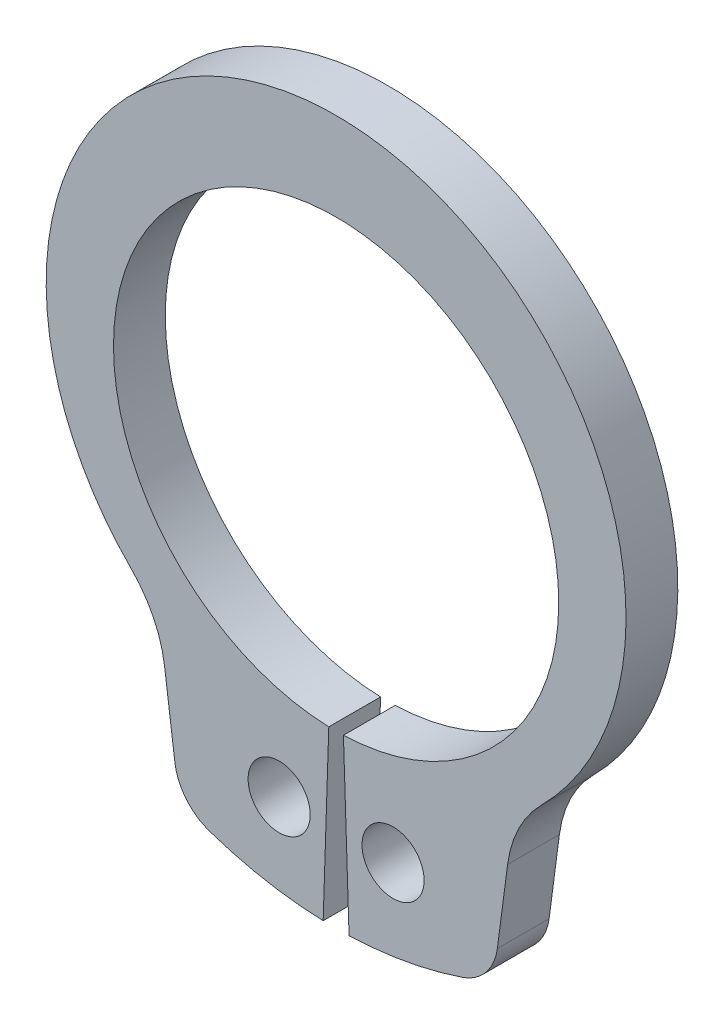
ISO-10303-21;
HEADER;
FILE_DESCRIPTION(('STEP AP214'),'2;1');
FILE_NAME('part.step','',(''),(''),'','','');
FILE_SCHEMA(('AUTOMOTIVE_DESIGN { 1 0 10303 214 1 1 1 1 }'));
ENDSEC;
DATA;
#1=APPLICATION_CONTEXT('core data for automotive mechanical design processes');
#2=APPLICATION_PROTOCOL_DEFINITION('international standard','automotive_design',2000,#1);
#3=PRODUCT_CONTEXT('',#1,'mechanical');
#4=PRODUCT('Part','Part','',(#3));
#5=PRODUCT_RELATED_PRODUCT_CATEGORY('part','',(#4));
#6=PRODUCT_DEFINITION_FORMATION('','',#4);
#7=PRODUCT_DEFINITION_CONTEXT('part definition',#1,'design');
#8=PRODUCT_DEFINITION('design','',#6,#7);
#9=PRODUCT_DEFINITION_SHAPE('','',#8);
#10=(LENGTH_UNIT() NAMED_UNIT(*) SI_UNIT(.MILLI.,.METRE.));
#11=(NAMED_UNIT(*) PLANE_ANGLE_UNIT() SI_UNIT($,.RADIAN.));
#12=(NAMED_UNIT(*) SI_UNIT($,.STERADIAN.) SOLID_ANGLE_UNIT());
#13=UNCERTAINTY_MEASURE_WITH_UNIT(LENGTH_MEASURE(1.E-05),#10,'distance_accuracy_value','');
#14=(GEOMETRIC_REPRESENTATION_CONTEXT(3) GLOBAL_UNCERTAINTY_ASSIGNED_CONTEXT((#13)) GLOBAL_UNIT_ASSIGNED_CONTEXT((#10,
#11,#12)) REPRESENTATION_CONTEXT('',''));
#15=CARTESIAN_POINT('',(0.,0.,0.));
#16=DIRECTION('',(0.,0.,1.));
#17=DIRECTION('',(1.,0.,0.));
#18=AXIS2_PLACEMENT_3D('',#15,#16,#17);
#19=CARTESIAN_POINT('',(0.,0.,-1.));
#20=DIRECTION('',(0.,0.,1.));
#21=DIRECTION('',(1.,0.,0.));
#22=AXIS2_PLACEMENT_3D('',#19,#20,#21);
#23=CYLINDRICAL_SURFACE('',#22,4.3);
#24=CARTESIAN_POINT('',(0.,0.,0.));
#25=DIRECTION('',(0.,0.,-1.));
#26=DIRECTION('',(1.,0.,0.));
#27=AXIS2_PLACEMENT_3D('',#24,#25,#26);
#28=CIRCLE('',#27,4.3);
#29=CARTESIAN_POINT('',(-0.141447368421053,-4.29767293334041,0.));
#30=VERTEX_POINT('',#29);
#31=CARTESIAN_POINT('',(0.141447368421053,-4.29767293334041,0.));
#32=VERTEX_POINT('',#31);
#33=EDGE_CURVE('E154',#30,#32,#28,.T.);
#34=ORIENTED_EDGE('',*,*,#33,.F.);
#35=DIRECTION('',(0.,0.,1.));
#36=VECTOR('',#35,1.);
#37=CARTESIAN_POINT('',(-0.141447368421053,-4.29767293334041,-1.));
#38=LINE('',#37,#36);
#39=CARTESIAN_POINT('',(-0.141447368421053,-4.29767293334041,-1.));
#40=VERTEX_POINT('',#39);
#41=EDGE_CURVE('E11',#40,#30,#38,.T.);
#42=ORIENTED_EDGE('',*,*,#41,.F.);
#43=CARTESIAN_POINT('',(0.,0.,-1.));
#44=DIRECTION('',(0.,0.,-1.));
#45=DIRECTION('',(1.,0.,0.));
#46=AXIS2_PLACEMENT_3D('',#43,#44,#45);
#47=CIRCLE('',#46,4.3);
#48=CARTESIAN_POINT('',(0.141447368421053,-4.29767293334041,-1.));
#49=VERTEX_POINT('',#48);
#50=EDGE_CURVE('E187',#40,#49,#47,.T.);
#51=ORIENTED_EDGE('',*,*,#50,.T.);
#52=DIRECTION('',(0.,0.,1.));
#53=VECTOR('',#52,1.);
#54=CARTESIAN_POINT('',(0.141447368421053,-4.29767293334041,-1.));
#55=LINE('',#54,#53);
#56=EDGE_CURVE('E36',#49,#32,#55,.T.);
#57=ORIENTED_EDGE('',*,*,#56,.T.);
#58=EDGE_LOOP('',(#34,#42,#51,#57));
#59=FACE_BOUND('',#58,.T.);
#60=ADVANCED_FACE('F33',(#59),#23,.F.);
#61=CARTESIAN_POINT('',(-0.141447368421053,-4.29767293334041,-1.));
#62=DIRECTION('',(0.999458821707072,-0.0328947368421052,0.));
#63=DIRECTION('',(0.0328947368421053,0.999458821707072,0.));
#64=AXIS2_PLACEMENT_3D('',#61,#62,#63);
#65=PLANE('',#64);
#66=DIRECTION('',(0.0328947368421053,0.999458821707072,0.));
#67=VECTOR('',#66,1.);
#68=CARTESIAN_POINT('',(-0.141447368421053,-4.29767293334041,0.));
#69=LINE('',#68,#67);
#70=CARTESIAN_POINT('',(-0.25,-7.59588704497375,0.));
#71=VERTEX_POINT('',#70);
#72=EDGE_CURVE('E185',#71,#30,#69,.T.);
#73=ORIENTED_EDGE('',*,*,#72,.F.);
#74=DIRECTION('',(0.,0.,1.));
#75=VECTOR('',#74,1.);
#76=CARTESIAN_POINT('',(-0.25,-7.59588704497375,-1.));
#77=LINE('',#76,#75);
#78=CARTESIAN_POINT('',(-0.25,-7.59588704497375,-1.));
#79=VERTEX_POINT('',#78);
#80=EDGE_CURVE('E42',#79,#71,#77,.T.);
#81=ORIENTED_EDGE('',*,*,#80,.F.);
#82=DIRECTION('',(0.0328947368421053,0.999458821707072,0.));
#83=VECTOR('',#82,1.);
#84=CARTESIAN_POINT('',(-0.141447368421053,-4.29767293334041,-1.));
#85=LINE('',#84,#83);
#86=EDGE_CURVE('E144',#79,#40,#85,.T.);
#87=ORIENTED_EDGE('',*,*,#86,.T.);
#88=ORIENTED_EDGE('',*,*,#41,.T.);
#89=EDGE_LOOP('',(#73,#81,#87,#88));
#90=FACE_BOUND('',#89,.T.);
#91=ADVANCED_FACE('F207',(#90),#65,.T.);
#92=CARTESIAN_POINT('',(0.,0.,-1.));
#93=DIRECTION('',(0.,0.,1.));
#94=DIRECTION('',(1.,0.,0.));
#95=AXIS2_PLACEMENT_3D('',#92,#93,#94);
#96=CYLINDRICAL_SURFACE('',#95,7.6);
#97=CARTESIAN_POINT('',(0.,0.,0.));
#98=DIRECTION('',(0.,0.,1.));
#99=DIRECTION('',(1.,0.,0.));
#100=AXIS2_PLACEMENT_3D('',#97,#98,#99);
#101=CIRCLE('',#100,7.6);
#102=CARTESIAN_POINT('',(-2.44440567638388,-7.19617126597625,0.));
#103=VERTEX_POINT('',#102);
#104=EDGE_CURVE('E131',#103,#71,#101,.T.);
#105=ORIENTED_EDGE('',*,*,#104,.F.);
#106=DIRECTION('',(0.,0.,1.));
#107=VECTOR('',#106,1.);
#108=CARTESIAN_POINT('',(-2.44440567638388,-7.19617126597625,-1.));
#109=LINE('',#108,#107);
#110=CARTESIAN_POINT('',(-2.44440567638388,-7.19617126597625,-1.));
#111=VERTEX_POINT('',#110);
#112=EDGE_CURVE('E126',#111,#103,#109,.T.);
#113=ORIENTED_EDGE('',*,*,#112,.F.);
#114=CARTESIAN_POINT('',(0.,0.,-1.));
#115=DIRECTION('',(0.,0.,1.));
#116=DIRECTION('',(1.,0.,0.));
#117=AXIS2_PLACEMENT_3D('',#114,#115,#116);
#118=CIRCLE('',#117,7.6);
#119=EDGE_CURVE('E129',#111,#79,#118,.T.);
#120=ORIENTED_EDGE('',*,*,#119,.T.);
#121=ORIENTED_EDGE('',*,*,#80,.T.);
#122=EDGE_LOOP('',(#105,#113,#120,#121));
#123=FACE_BOUND('',#122,.T.);
#124=ADVANCED_FACE('F128',(#123),#96,.T.);
#125=CARTESIAN_POINT('',(-2.1227733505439,-6.24930662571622,-1.));
#126=DIRECTION('',(0.,0.,1.));
#127=DIRECTION('',(1.,0.,0.));
#128=AXIS2_PLACEMENT_3D('',#125,#126,#127);
#129=CYLINDRICAL_SURFACE('',#128,1.);
#130=CARTESIAN_POINT('',(-2.1227733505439,-6.24930662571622,0.));
#131=DIRECTION('',(0.,0.,1.));
#132=DIRECTION('',(1.,0.,0.));
#133=AXIS2_PLACEMENT_3D('',#130,#131,#132);
#134=CIRCLE('',#133,1.);
#135=CARTESIAN_POINT('',(-3.11421821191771,-6.37983281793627,0.));
#136=VERTEX_POINT('',#135);
#137=EDGE_CURVE('E182',#136,#103,#134,.T.);
#138=ORIENTED_EDGE('',*,*,#137,.F.);
#139=DIRECTION('',(0.,0.,1.));
#140=VECTOR('',#139,1.);
#141=CARTESIAN_POINT('',(-3.11421821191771,-6.37983281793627,-1.));
#142=LINE('',#141,#140);
#143=CARTESIAN_POINT('',(-3.11421821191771,-6.37983281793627,-1.));
#144=VERTEX_POINT('',#143);
#145=EDGE_CURVE('E136',#144,#136,#142,.T.);
#146=ORIENTED_EDGE('',*,*,#145,.F.);
#147=CARTESIAN_POINT('',(-2.1227733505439,-6.24930662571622,-1.));
#148=DIRECTION('',(0.,0.,1.));
#149=DIRECTION('',(1.,0.,0.));
#150=AXIS2_PLACEMENT_3D('',#147,#148,#149);
#151=CIRCLE('',#150,1.);
#152=EDGE_CURVE('E142',#144,#111,#151,.T.);
#153=ORIENTED_EDGE('',*,*,#152,.T.);
#154=ORIENTED_EDGE('',*,*,#112,.T.);
#155=EDGE_LOOP('',(#138,#146,#153,#154));
#156=FACE_BOUND('',#155,.T.);
#157=ADVANCED_FACE('F146',(#156),#129,.T.);
#158=CARTESIAN_POINT('',(-3.3126983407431,-4.87222656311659,-1.));
#159=DIRECTION('',(-0.99144486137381,-0.130526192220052,0.));
#160=DIRECTION('',(0.130526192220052,-0.99144486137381,0.));
#161=AXIS2_PLACEMENT_3D('',#158,#159,#160);
#162=PLANE('',#161);
#163=DIRECTION('',(0.130526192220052,-0.99144486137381,0.));
#164=VECTOR('',#163,1.);
#165=CARTESIAN_POINT('',(-3.3126983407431,-4.87222656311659,0.));
#166=LINE('',#165,#164);
#167=CARTESIAN_POINT('',(-3.3126983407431,-4.87222656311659,0.));
#168=VERTEX_POINT('',#167);
#169=EDGE_CURVE('E179',#168,#136,#166,.T.);
#170=ORIENTED_EDGE('',*,*,#169,.F.);
#171=DIRECTION('',(0.,0.,1.));
#172=VECTOR('',#171,1.);
#173=CARTESIAN_POINT('',(-3.3126983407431,-4.87222656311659,-1.));
#174=LINE('',#173,#172);
#175=CARTESIAN_POINT('',(-3.3126983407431,-4.87222656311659,-1.));
#176=VERTEX_POINT('',#175);
#177=EDGE_CURVE('E191',#176,#168,#174,.T.);
#178=ORIENTED_EDGE('',*,*,#177,.F.);
#179=DIRECTION('',(0.130526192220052,-0.99144486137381,0.));
#180=VECTOR('',#179,1.);
#181=CARTESIAN_POINT('',(-3.3126983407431,-4.87222656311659,-1.));
#182=LINE('',#181,#180);
#183=EDGE_CURVE('E147',#176,#144,#182,.T.);
#184=ORIENTED_EDGE('',*,*,#183,.T.);
#185=ORIENTED_EDGE('',*,*,#145,.T.);
#186=EDGE_LOOP('',(#170,#178,#184,#185));
#187=FACE_BOUND('',#186,.T.);
#188=ADVANCED_FACE('F220',(#187),#162,.T.);
#189=CARTESIAN_POINT('',(-5.57098718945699,-5.16953593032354,-1.));
#190=DIRECTION('',(0.,0.,1.));
#191=DIRECTION('',(1.,0.,0.));
#192=AXIS2_PLACEMENT_3D('',#189,#190,#191);
#193=CYLINDRICAL_SURFACE('',#192,2.27777553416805);
#194=CARTESIAN_POINT('',(-5.57098718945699,-5.16953593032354,0.));
#195=DIRECTION('',(0.,0.,-1.));
#196=DIRECTION('',(1.,0.,0.));
#197=AXIS2_PLACEMENT_3D('',#194,#195,#196);
#198=CIRCLE('',#197,2.27777553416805);
#199=CARTESIAN_POINT('',(-3.96016685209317,-3.55909523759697,0.));
#200=VERTEX_POINT('',#199);
#201=EDGE_CURVE('E176',#200,#168,#198,.T.);
#202=ORIENTED_EDGE('',*,*,#201,.F.);
#203=DIRECTION('',(0.,0.,1.));
#204=VECTOR('',#203,1.);
#205=CARTESIAN_POINT('',(-3.96016685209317,-3.55909523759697,-1.));
#206=LINE('',#205,#204);
#207=CARTESIAN_POINT('',(-3.96016685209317,-3.55909523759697,-1.));
#208=VERTEX_POINT('',#207);
#209=EDGE_CURVE('E193',#208,#200,#206,.T.);
#210=ORIENTED_EDGE('',*,*,#209,.F.);
#211=CARTESIAN_POINT('',(-5.57098718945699,-5.16953593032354,-1.));
#212=DIRECTION('',(0.,0.,-1.));
#213=DIRECTION('',(1.,0.,0.));
#214=AXIS2_PLACEMENT_3D('',#211,#212,#213);
#215=CIRCLE('',#214,2.27777553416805);
#216=EDGE_CURVE('E149',#208,#176,#215,.T.);
#217=ORIENTED_EDGE('',*,*,#216,.T.);
#218=ORIENTED_EDGE('',*,*,#177,.T.);
#219=EDGE_LOOP('',(#202,#210,#217,#218));
#220=FACE_BOUND('',#219,.T.);
#221=ADVANCED_FACE('F223',(#220),#193,.F.);
#222=CARTESIAN_POINT('',(0.,0.400138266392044,-1.));
#223=DIRECTION('',(0.,0.,1.));
#224=DIRECTION('',(1.,0.,0.));
#225=AXIS2_PLACEMENT_3D('',#222,#223,#224);
#226=CYLINDRICAL_SURFACE('',#225,5.59986173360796);
#227=CARTESIAN_POINT('',(0.,0.400138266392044,0.));
#228=DIRECTION('',(0.,0.,1.));
#229=DIRECTION('',(1.,0.,0.));
#230=AXIS2_PLACEMENT_3D('',#227,#228,#229);
#231=CIRCLE('',#230,5.59986173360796);
#232=CARTESIAN_POINT('',(3.96016685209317,-3.55909523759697,0.));
#233=VERTEX_POINT('',#232);
#234=EDGE_CURVE('E173',#233,#200,#231,.T.);
#235=ORIENTED_EDGE('',*,*,#234,.F.);
#236=DIRECTION('',(0.,0.,1.));
#237=VECTOR('',#236,1.);
#238=CARTESIAN_POINT('',(3.96016685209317,-3.55909523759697,-1.));
#239=LINE('',#238,#237);
#240=CARTESIAN_POINT('',(3.96016685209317,-3.55909523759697,-1.));
#241=VERTEX_POINT('',#240);
#242=EDGE_CURVE('E195',#241,#233,#239,.T.);
#243=ORIENTED_EDGE('',*,*,#242,.F.);
#244=CARTESIAN_POINT('',(0.,0.400138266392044,-1.));
#245=DIRECTION('',(0.,0.,1.));
#246=DIRECTION('',(1.,0.,0.));
#247=AXIS2_PLACEMENT_3D('',#244,#245,#246);
#248=CIRCLE('',#247,5.59986173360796);
#249=EDGE_CURVE('E297',#241,#208,#248,.T.);
#250=ORIENTED_EDGE('',*,*,#249,.T.);
#251=ORIENTED_EDGE('',*,*,#209,.T.);
#252=EDGE_LOOP('',(#235,#243,#250,#251));
#253=FACE_BOUND('',#252,.T.);
#254=ADVANCED_FACE('F227',(#253),#226,.T.);
#255=CARTESIAN_POINT('',(5.57098718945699,-5.16953593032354,-1.));
#256=DIRECTION('',(0.,0.,1.));
#257=DIRECTION('',(1.,0.,0.));
#258=AXIS2_PLACEMENT_3D('',#255,#256,#257);
#259=CYLINDRICAL_SURFACE('',#258,2.27777553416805);
#260=CARTESIAN_POINT('',(5.57098718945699,-5.16953593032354,0.));
#261=DIRECTION('',(0.,0.,-1.));
#262=DIRECTION('',(1.,0.,0.));
#263=AXIS2_PLACEMENT_3D('',#260,#261,#262);
#264=CIRCLE('',#263,2.27777553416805);
#265=CARTESIAN_POINT('',(3.3126983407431,-4.87222656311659,0.));
#266=VERTEX_POINT('',#265);
#267=EDGE_CURVE('E170',#266,#233,#264,.T.);
#268=ORIENTED_EDGE('',*,*,#267,.F.);
#269=DIRECTION('',(0.,0.,1.));
#270=VECTOR('',#269,1.);
#271=CARTESIAN_POINT('',(3.3126983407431,-4.87222656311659,-1.));
#272=LINE('',#271,#270);
#273=CARTESIAN_POINT('',(3.3126983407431,-4.87222656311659,-1.));
#274=VERTEX_POINT('',#273);
#275=EDGE_CURVE('E197',#274,#266,#272,.T.);
#276=ORIENTED_EDGE('',*,*,#275,.F.);
#277=CARTESIAN_POINT('',(5.57098718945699,-5.16953593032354,-1.));
#278=DIRECTION('',(0.,0.,-1.));
#279=DIRECTION('',(1.,0.,0.));
#280=AXIS2_PLACEMENT_3D('',#277,#278,#279);
#281=CIRCLE('',#280,2.27777553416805);
#282=EDGE_CURVE('E294',#274,#241,#281,.T.);
#283=ORIENTED_EDGE('',*,*,#282,.T.);
#284=ORIENTED_EDGE('',*,*,#242,.T.);
#285=EDGE_LOOP('',(#268,#276,#283,#284));
#286=FACE_BOUND('',#285,.T.);
#287=ADVANCED_FACE('F231',(#286),#259,.F.);
#288=CARTESIAN_POINT('',(3.3126983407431,-4.87222656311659,-1.));
#289=DIRECTION('',(0.99144486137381,-0.130526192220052,0.));
#290=DIRECTION('',(0.130526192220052,0.99144486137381,0.));
#291=AXIS2_PLACEMENT_3D('',#288,#289,#290);
#292=PLANE('',#291);
#293=DIRECTION('',(0.130526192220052,0.99144486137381,0.));
#294=VECTOR('',#293,1.);
#295=CARTESIAN_POINT('',(3.3126983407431,-4.87222656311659,0.));
#296=LINE('',#295,#294);
#297=CARTESIAN_POINT('',(3.11421821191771,-6.37983281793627,0.));
#298=VERTEX_POINT('',#297);
#299=EDGE_CURVE('E167',#298,#266,#296,.T.);
#300=ORIENTED_EDGE('',*,*,#299,.F.);
#301=DIRECTION('',(0.,0.,1.));
#302=VECTOR('',#301,1.);
#303=CARTESIAN_POINT('',(3.11421821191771,-6.37983281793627,-1.));
#304=LINE('',#303,#302);
#305=CARTESIAN_POINT('',(3.11421821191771,-6.37983281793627,-1.));
#306=VERTEX_POINT('',#305);
#307=EDGE_CURVE('E199',#306,#298,#304,.T.);
#308=ORIENTED_EDGE('',*,*,#307,.F.);
#309=DIRECTION('',(0.130526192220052,0.99144486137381,0.));
#310=VECTOR('',#309,1.);
#311=CARTESIAN_POINT('',(3.3126983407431,-4.87222656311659,-1.));
#312=LINE('',#311,#310);
#313=EDGE_CURVE('E291',#306,#274,#312,.T.);
#314=ORIENTED_EDGE('',*,*,#313,.T.);
#315=ORIENTED_EDGE('',*,*,#275,.T.);
#316=EDGE_LOOP('',(#300,#308,#314,#315));
#317=FACE_BOUND('',#316,.T.);
#318=ADVANCED_FACE('F235',(#317),#292,.T.);
#319=CARTESIAN_POINT('',(2.1227733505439,-6.24930662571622,-1.));
#320=DIRECTION('',(0.,0.,1.));
#321=DIRECTION('',(1.,0.,0.));
#322=AXIS2_PLACEMENT_3D('',#319,#320,#321);
#323=CYLINDRICAL_SURFACE('',#322,1.);
#324=CARTESIAN_POINT('',(2.1227733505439,-6.24930662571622,0.));
#325=DIRECTION('',(0.,0.,1.));
#326=DIRECTION('',(-1.,0.,0.));
#327=AXIS2_PLACEMENT_3D('',#324,#325,#326);
#328=CIRCLE('',#327,1.);
#329=CARTESIAN_POINT('',(2.44440567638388,-7.19617126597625,0.));
#330=VERTEX_POINT('',#329);
#331=EDGE_CURVE('E164',#330,#298,#328,.T.);
#332=ORIENTED_EDGE('',*,*,#331,.F.);
#333=DIRECTION('',(0.,0.,1.));
#334=VECTOR('',#333,1.);
#335=CARTESIAN_POINT('',(2.44440567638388,-7.19617126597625,-1.));
#336=LINE('',#335,#334);
#337=CARTESIAN_POINT('',(2.44440567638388,-7.19617126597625,-1.));
#338=VERTEX_POINT('',#337);
#339=EDGE_CURVE('E201',#338,#330,#336,.T.);
#340=ORIENTED_EDGE('',*,*,#339,.F.);
#341=CARTESIAN_POINT('',(2.1227733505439,-6.24930662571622,-1.));
#342=DIRECTION('',(0.,0.,1.));
#343=DIRECTION('',(-1.,0.,0.));
#344=AXIS2_PLACEMENT_3D('',#341,#342,#343);
#345=CIRCLE('',#344,1.);
#346=EDGE_CURVE('E288',#338,#306,#345,.T.);
#347=ORIENTED_EDGE('',*,*,#346,.T.);
#348=ORIENTED_EDGE('',*,*,#307,.T.);
#349=EDGE_LOOP('',(#332,#340,#347,#348));
#350=FACE_BOUND('',#349,.T.);
#351=ADVANCED_FACE('F239',(#350),#323,.T.);
#352=CARTESIAN_POINT('',(0.,0.,-1.));
#353=DIRECTION('',(0.,0.,1.));
#354=DIRECTION('',(1.,0.,0.));
#355=AXIS2_PLACEMENT_3D('',#352,#353,#354);
#356=CYLINDRICAL_SURFACE('',#355,7.6);
#357=CARTESIAN_POINT('',(0.,0.,0.));
#358=DIRECTION('',(0.,0.,1.));
#359=DIRECTION('',(1.,0.,0.));
#360=AXIS2_PLACEMENT_3D('',#357,#358,#359);
#361=CIRCLE('',#360,7.6);
#362=CARTESIAN_POINT('',(0.249999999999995,-7.59588704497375,0.));
#363=VERTEX_POINT('',#362);
#364=EDGE_CURVE('E161',#363,#330,#361,.T.);
#365=ORIENTED_EDGE('',*,*,#364,.F.);
#366=DIRECTION('',(0.,0.,1.));
#367=VECTOR('',#366,1.);
#368=CARTESIAN_POINT('',(0.249999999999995,-7.59588704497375,-1.));
#369=LINE('',#368,#367);
#370=CARTESIAN_POINT('',(0.249999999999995,-7.59588704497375,-1.));
#371=VERTEX_POINT('',#370);
#372=EDGE_CURVE('E202',#371,#363,#369,.T.);
#373=ORIENTED_EDGE('',*,*,#372,.F.);
#374=CARTESIAN_POINT('',(0.,0.,-1.));
#375=DIRECTION('',(0.,0.,1.));
#376=DIRECTION('',(1.,0.,0.));
#377=AXIS2_PLACEMENT_3D('',#374,#375,#376);
#378=CIRCLE('',#377,7.6);
#379=EDGE_CURVE('E285',#371,#338,#378,.T.);
#380=ORIENTED_EDGE('',*,*,#379,.T.);
#381=ORIENTED_EDGE('',*,*,#339,.T.);
#382=EDGE_LOOP('',(#365,#373,#380,#381));
#383=FACE_BOUND('',#382,.T.);
#384=ADVANCED_FACE('F243',(#383),#356,.T.);
#385=CARTESIAN_POINT('',(0.141447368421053,-4.29767293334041,-1.));
#386=DIRECTION('',(-0.999458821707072,-0.0328947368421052,0.));
#387=DIRECTION('',(0.0328947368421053,-0.999458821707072,0.));
#388=AXIS2_PLACEMENT_3D('',#385,#386,#387);
#389=PLANE('',#388);
#390=DIRECTION('',(0.0328947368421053,-0.999458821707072,0.));
#391=VECTOR('',#390,1.);
#392=CARTESIAN_POINT('',(0.141447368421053,-4.29767293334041,0.));
#393=LINE('',#392,#391);
#394=EDGE_CURVE('E157',#32,#363,#393,.T.);
#395=ORIENTED_EDGE('',*,*,#394,.F.);
#396=ORIENTED_EDGE('',*,*,#56,.F.);
#397=DIRECTION('',(0.0328947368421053,-0.999458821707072,0.));
#398=VECTOR('',#397,1.);
#399=CARTESIAN_POINT('',(0.141447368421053,-4.29767293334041,-1.));
#400=LINE('',#399,#398);
#401=EDGE_CURVE('E283',#49,#371,#400,.T.);
#402=ORIENTED_EDGE('',*,*,#401,.T.);
#403=ORIENTED_EDGE('',*,*,#372,.T.);
#404=EDGE_LOOP('',(#395,#396,#402,#403));
#405=FACE_BOUND('',#404,.T.);
#406=ADVANCED_FACE('F204',(#405),#389,.T.);
#407=CARTESIAN_POINT('',(0.,0.,-1.));
#408=DIRECTION('',(0.,0.,1.));
#409=DIRECTION('',(1.,0.,0.));
#410=AXIS2_PLACEMENT_3D('',#407,#408,#409);
#411=PLANE('',#410);
#412=CARTESIAN_POINT('',(-1.1,-5.94915960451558,-1.));
#413=DIRECTION('',(0.,0.,1.));
#414=DIRECTION('',(1.,0.,0.));
#415=AXIS2_PLACEMENT_3D('',#412,#413,#414);
#416=CIRCLE('',#415,0.6);
#417=CARTESIAN_POINT('',(-0.5,-5.94915960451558,-1.));
#418=VERTEX_POINT('',#417);
#419=EDGE_CURVE('E270',#418,#418,#416,.T.);
#420=ORIENTED_EDGE('',*,*,#419,.T.);
#421=EDGE_LOOP('',(#420));
#422=FACE_BOUND('',#421,.T.);
#423=CARTESIAN_POINT('',(1.1,-5.94915960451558,-1.));
#424=DIRECTION('',(0.,0.,1.));
#425=DIRECTION('',(1.,0.,0.));
#426=AXIS2_PLACEMENT_3D('',#423,#424,#425);
#427=CIRCLE('',#426,0.6);
#428=CARTESIAN_POINT('',(1.7,-5.94915960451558,-1.));
#429=VERTEX_POINT('',#428);
#430=EDGE_CURVE('E158',#429,#429,#427,.T.);
#431=ORIENTED_EDGE('',*,*,#430,.T.);
#432=EDGE_LOOP('',(#431));
#433=FACE_BOUND('',#432,.T.);
#434=ORIENTED_EDGE('',*,*,#50,.F.);
#435=ORIENTED_EDGE('',*,*,#86,.F.);
#436=ORIENTED_EDGE('',*,*,#119,.F.);
#437=ORIENTED_EDGE('',*,*,#152,.F.);
#438=ORIENTED_EDGE('',*,*,#183,.F.);
#439=ORIENTED_EDGE('',*,*,#216,.F.);
#440=ORIENTED_EDGE('',*,*,#249,.F.);
#441=ORIENTED_EDGE('',*,*,#282,.F.);
#442=ORIENTED_EDGE('',*,*,#313,.F.);
#443=ORIENTED_EDGE('',*,*,#346,.F.);
#444=ORIENTED_EDGE('',*,*,#379,.F.);
#445=ORIENTED_EDGE('',*,*,#401,.F.);
#446=EDGE_LOOP('',(#434,#435,#436,#437,#438,#439,#440,#441,#442,#443,#444,#445));
#447=FACE_BOUND('',#446,.T.);
#448=ADVANCED_FACE('F140',(#422,#433,#447),#411,.F.);
#449=CARTESIAN_POINT('',(0.,0.,0.));
#450=DIRECTION('',(0.,0.,1.));
#451=DIRECTION('',(1.,0.,0.));
#452=AXIS2_PLACEMENT_3D('',#449,#450,#451);
#453=PLANE('',#452);
#454=CARTESIAN_POINT('',(-1.1,-5.94915960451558,0.));
#455=DIRECTION('',(0.,0.,1.));
#456=DIRECTION('',(1.,0.,0.));
#457=AXIS2_PLACEMENT_3D('',#454,#455,#456);
#458=CIRCLE('',#457,0.6);
#459=CARTESIAN_POINT('',(-0.5,-5.94915960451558,0.));
#460=VERTEX_POINT('',#459);
#461=EDGE_CURVE('E273',#460,#460,#458,.T.);
#462=ORIENTED_EDGE('',*,*,#461,.F.);
#463=EDGE_LOOP('',(#462));
#464=FACE_BOUND('',#463,.T.);
#465=CARTESIAN_POINT('',(1.1,-5.94915960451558,0.));
#466=DIRECTION('',(0.,0.,1.));
#467=DIRECTION('',(1.,0.,0.));
#468=AXIS2_PLACEMENT_3D('',#465,#466,#467);
#469=CIRCLE('',#468,0.6);
#470=CARTESIAN_POINT('',(1.7,-5.94915960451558,0.));
#471=VERTEX_POINT('',#470);
#472=EDGE_CURVE('E275',#471,#471,#469,.T.);
#473=ORIENTED_EDGE('',*,*,#472,.F.);
#474=EDGE_LOOP('',(#473));
#475=FACE_BOUND('',#474,.T.);
#476=ORIENTED_EDGE('',*,*,#33,.T.);
#477=ORIENTED_EDGE('',*,*,#394,.T.);
#478=ORIENTED_EDGE('',*,*,#364,.T.);
#479=ORIENTED_EDGE('',*,*,#331,.T.);
#480=ORIENTED_EDGE('',*,*,#299,.T.);
#481=ORIENTED_EDGE('',*,*,#267,.T.);
#482=ORIENTED_EDGE('',*,*,#234,.T.);
#483=ORIENTED_EDGE('',*,*,#201,.T.);
#484=ORIENTED_EDGE('',*,*,#169,.T.);
#485=ORIENTED_EDGE('',*,*,#137,.T.);
#486=ORIENTED_EDGE('',*,*,#104,.T.);
#487=ORIENTED_EDGE('',*,*,#72,.T.);
#488=EDGE_LOOP('',(#476,#477,#478,#479,#480,#481,#482,#483,#484,#485,#486,#487));
#489=FACE_BOUND('',#488,.T.);
#490=ADVANCED_FACE('F206',(#464,#475,#489),#453,.T.);
#491=CARTESIAN_POINT('',(1.1,-5.94915960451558,-1.));
#492=DIRECTION('',(0.,0.,1.));
#493=DIRECTION('',(1.,0.,0.));
#494=AXIS2_PLACEMENT_3D('',#491,#492,#493);
#495=CYLINDRICAL_SURFACE('',#494,0.6);
#496=ORIENTED_EDGE('',*,*,#430,.F.);
#497=EDGE_LOOP('',(#496));
#498=FACE_BOUND('',#497,.T.);
#499=ORIENTED_EDGE('',*,*,#472,.T.);
#500=EDGE_LOOP('',(#499));
#501=FACE_BOUND('',#500,.T.);
#502=ADVANCED_FACE('F255',(#498,#501),#495,.F.);
#503=CARTESIAN_POINT('',(-1.1,-5.94915960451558,-1.));
#504=DIRECTION('',(0.,0.,1.));
#505=DIRECTION('',(1.,0.,0.));
#506=AXIS2_PLACEMENT_3D('',#503,#504,#505);
#507=CYLINDRICAL_SURFACE('',#506,0.6);
#508=ORIENTED_EDGE('',*,*,#419,.F.);
#509=EDGE_LOOP('',(#508));
#510=FACE_BOUND('',#509,.T.);
#511=ORIENTED_EDGE('',*,*,#461,.T.);
#512=EDGE_LOOP('',(#511));
#513=FACE_BOUND('',#512,.T.);
#514=ADVANCED_FACE('F262',(#510,#513),#507,.F.);
#515=CLOSED_SHELL('',(#60,#91,#124,#157,#188,#221,#254,#287,#318,#351,#384,#406,#448,#490,#502,#514));
#516=MANIFOLD_SOLID_BREP('B2',#515);
#517=ADVANCED_BREP_SHAPE_REPRESENTATION('',(#18,#516),#14);
#518=SHAPE_DEFINITION_REPRESENTATION(#9,#517);
ENDSEC;
END-ISO-10303-21;
